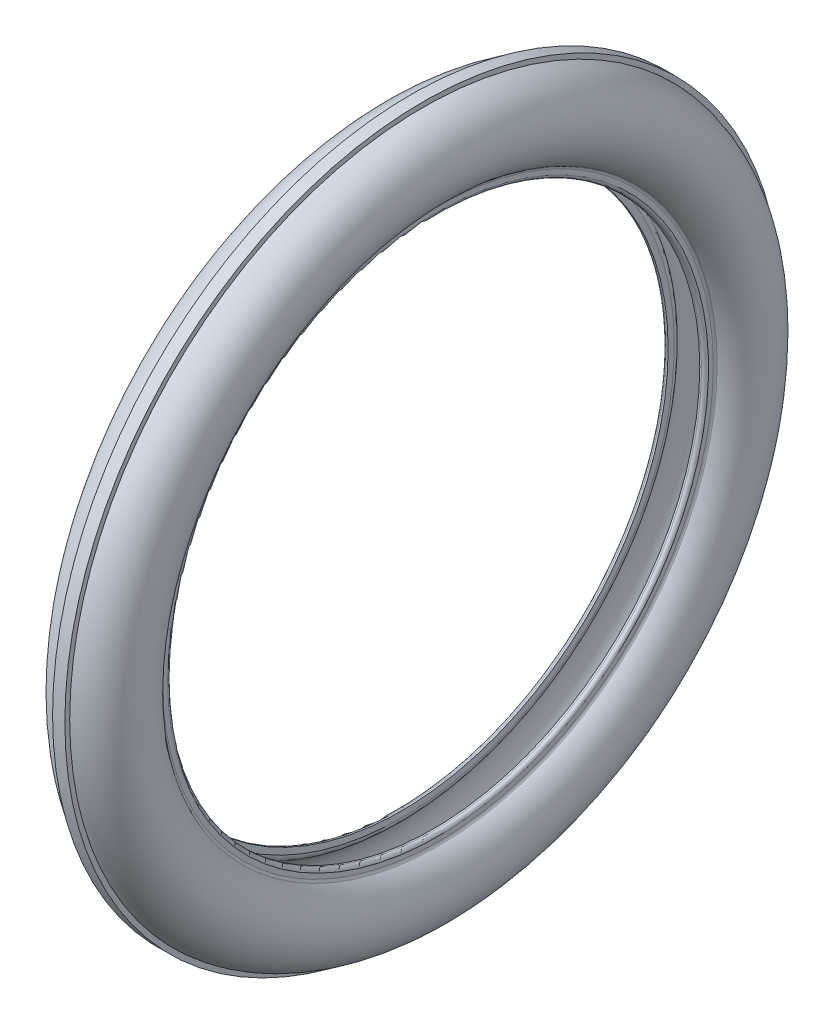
ISO-10303-21;
HEADER;
FILE_DESCRIPTION(('STEP AP214'),'2;1');
FILE_NAME('part.step','',(''),(''),'','','');
FILE_SCHEMA(('AUTOMOTIVE_DESIGN { 1 0 10303 214 1 1 1 1 }'));
ENDSEC;
DATA;
#1=APPLICATION_CONTEXT('core data for automotive mechanical design processes');
#2=APPLICATION_PROTOCOL_DEFINITION('international standard','automotive_design',2000,#1);
#3=PRODUCT_CONTEXT('',#1,'mechanical');
#4=PRODUCT('Part','Part','',(#3));
#5=PRODUCT_RELATED_PRODUCT_CATEGORY('part','',(#4));
#6=PRODUCT_DEFINITION_FORMATION('','',#4);
#7=PRODUCT_DEFINITION_CONTEXT('part definition',#1,'design');
#8=PRODUCT_DEFINITION('design','',#6,#7);
#9=PRODUCT_DEFINITION_SHAPE('','',#8);
#10=(LENGTH_UNIT() NAMED_UNIT(*) SI_UNIT(.MILLI.,.METRE.));
#11=(NAMED_UNIT(*) PLANE_ANGLE_UNIT() SI_UNIT($,.RADIAN.));
#12=(NAMED_UNIT(*) SI_UNIT($,.STERADIAN.) SOLID_ANGLE_UNIT());
#13=UNCERTAINTY_MEASURE_WITH_UNIT(LENGTH_MEASURE(1.E-05),#10,'distance_accuracy_value','');
#14=(GEOMETRIC_REPRESENTATION_CONTEXT(3) GLOBAL_UNCERTAINTY_ASSIGNED_CONTEXT((#13)) GLOBAL_UNIT_ASSIGNED_CONTEXT((#10,
#11,#12)) REPRESENTATION_CONTEXT('',''));
#15=CARTESIAN_POINT('',(0.,0.,0.));
#16=DIRECTION('',(0.,0.,1.));
#17=DIRECTION('',(1.,0.,0.));
#18=AXIS2_PLACEMENT_3D('',#15,#16,#17);
#19=CARTESIAN_POINT('',(-9.,152.,0.));
#20=DIRECTION('',(-1.,0.,0.));
#21=DIRECTION('',(0.,0.,1.));
#22=AXIS2_PLACEMENT_3D('',#19,#20,#21);
#23=PLANE('',#22);
#24=CARTESIAN_POINT('',(-8.99999999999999,0.,0.));
#25=DIRECTION('',(-1.,0.,0.));
#26=DIRECTION('',(0.,0.,1.));
#27=AXIS2_PLACEMENT_3D('',#24,#25,#26);
#28=CIRCLE('',#27,155.483339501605);
#29=CARTESIAN_POINT('',(-8.99999999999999,0.,155.483339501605));
#30=VERTEX_POINT('',#29);
#31=EDGE_CURVE('E10',#30,#30,#28,.T.);
#32=ORIENTED_EDGE('',*,*,#31,.F.);
#33=EDGE_LOOP('',(#32));
#34=FACE_BOUND('',#33,.T.);
#35=CARTESIAN_POINT('',(-9.,0.,0.));
#36=DIRECTION('',(-1.,0.,0.));
#37=DIRECTION('',(0.,0.,1.));
#38=AXIS2_PLACEMENT_3D('',#35,#36,#37);
#39=CIRCLE('',#38,152.);
#40=CARTESIAN_POINT('',(-9.,0.,152.));
#41=VERTEX_POINT('',#40);
#42=EDGE_CURVE('E62',#41,#41,#39,.T.);
#43=ORIENTED_EDGE('',*,*,#42,.T.);
#44=EDGE_LOOP('',(#43));
#45=FACE_BOUND('',#44,.T.);
#46=ADVANCED_FACE('F31',(#34,#45),#23,.F.);
#47=CARTESIAN_POINT('',(-13.,0.,0.));
#48=DIRECTION('',(-1.,0.,0.));
#49=DIRECTION('',(0.,0.,1.));
#50=AXIS2_PLACEMENT_3D('',#47,#48,#49);
#51=TOROIDAL_SURFACE('',#50,155.483339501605,4.00000000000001);
#52=CARTESIAN_POINT('',(-11.,0.,0.));
#53=DIRECTION('',(-1.,0.,0.));
#54=DIRECTION('',(0.,0.,1.));
#55=AXIS2_PLACEMENT_3D('',#52,#53,#54);
#56=CIRCLE('',#55,158.947441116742);
#57=CARTESIAN_POINT('',(-11.,0.,158.947441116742));
#58=VERTEX_POINT('',#57);
#59=EDGE_CURVE('E37',#58,#58,#56,.T.);
#60=ORIENTED_EDGE('',*,*,#59,.F.);
#61=EDGE_LOOP('',(#60));
#62=FACE_BOUND('',#61,.T.);
#63=ORIENTED_EDGE('',*,*,#31,.T.);
#64=EDGE_LOOP('',(#63));
#65=FACE_BOUND('',#64,.T.);
#66=ADVANCED_FACE('F113',(#62,#65),#51,.T.);
#67=CARTESIAN_POINT('',(0.,0.,0.));
#68=DIRECTION('',(-1.,0.,0.));
#69=DIRECTION('',(0.,0.,1.));
#70=AXIS2_PLACEMENT_3D('',#67,#68,#69);
#71=TOROIDAL_SURFACE('',#70,178.,22.);
#72=ORIENTED_EDGE('',*,*,#59,.T.);
#73=EDGE_LOOP('',(#72));
#74=FACE_BOUND('',#73,.T.);
#75=CARTESIAN_POINT('',(11.,0.,0.));
#76=DIRECTION('',(-1.,0.,0.));
#77=DIRECTION('',(0.,0.,1.));
#78=AXIS2_PLACEMENT_3D('',#75,#76,#77);
#79=CIRCLE('',#78,158.947441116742);
#80=CARTESIAN_POINT('',(11.,0.,158.947441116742));
#81=VERTEX_POINT('',#80);
#82=EDGE_CURVE('E68',#81,#81,#79,.T.);
#83=ORIENTED_EDGE('',*,*,#82,.F.);
#84=EDGE_LOOP('',(#83));
#85=FACE_BOUND('',#84,.T.);
#86=ADVANCED_FACE('F118',(#74,#85),#71,.F.);
#87=CARTESIAN_POINT('',(0.,0.,0.));
#88=DIRECTION('',(-1.,0.,0.));
#89=DIRECTION('',(0.,0.,1.));
#90=AXIS2_PLACEMENT_3D('',#87,#88,#89);
#91=CYLINDRICAL_SURFACE('',#90,204.);
#92=CARTESIAN_POINT('',(-3.5,0.,0.));
#93=DIRECTION('',(-1.,0.,0.));
#94=DIRECTION('',(0.,0.,1.));
#95=AXIS2_PLACEMENT_3D('',#92,#93,#94);
#96=CIRCLE('',#95,204.);
#97=CARTESIAN_POINT('',(-3.5,0.,204.));
#98=VERTEX_POINT('',#97);
#99=EDGE_CURVE('E41',#98,#98,#96,.T.);
#100=ORIENTED_EDGE('',*,*,#99,.F.);
#101=EDGE_LOOP('',(#100));
#102=FACE_BOUND('',#101,.T.);
#103=CARTESIAN_POINT('',(3.5,0.,0.));
#104=DIRECTION('',(-1.,0.,0.));
#105=DIRECTION('',(0.,0.,1.));
#106=AXIS2_PLACEMENT_3D('',#103,#104,#105);
#107=CIRCLE('',#106,204.);
#108=CARTESIAN_POINT('',(3.5,0.,204.));
#109=VERTEX_POINT('',#108);
#110=EDGE_CURVE('E71',#109,#109,#107,.T.);
#111=ORIENTED_EDGE('',*,*,#110,.T.);
#112=EDGE_LOOP('',(#111));
#113=FACE_BOUND('',#112,.T.);
#114=ADVANCED_FACE('F151',(#102,#113),#91,.T.);
#115=CARTESIAN_POINT('',(-3.5,201.237900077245,0.));
#116=DIRECTION('',(1.,0.,0.));
#117=DIRECTION('',(0.,0.,-1.));
#118=AXIS2_PLACEMENT_3D('',#115,#116,#117);
#119=PLANE('',#118);
#120=CARTESIAN_POINT('',(-3.5,0.,0.));
#121=DIRECTION('',(-1.,0.,0.));
#122=DIRECTION('',(0.,0.,1.));
#123=AXIS2_PLACEMENT_3D('',#120,#121,#122);
#124=CIRCLE('',#123,201.237900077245);
#125=CARTESIAN_POINT('',(-3.5,0.,201.237900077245));
#126=VERTEX_POINT('',#125);
#127=EDGE_CURVE('E45',#126,#126,#124,.T.);
#128=ORIENTED_EDGE('',*,*,#127,.F.);
#129=EDGE_LOOP('',(#128));
#130=FACE_BOUND('',#129,.T.);
#131=ORIENTED_EDGE('',*,*,#99,.T.);
#132=EDGE_LOOP('',(#131));
#133=FACE_BOUND('',#132,.T.);
#134=ADVANCED_FACE('F145',(#130,#133),#119,.F.);
#135=CARTESIAN_POINT('',(0.,0.,0.));
#136=DIRECTION('',(-1.,0.,0.));
#137=DIRECTION('',(0.,0.,1.));
#138=AXIS2_PLACEMENT_3D('',#135,#136,#137);
#139=TOROIDAL_SURFACE('',#138,178.,23.5);
#140=CARTESIAN_POINT('',(-12.6782802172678,0.,0.));
#141=DIRECTION('',(-1.,0.,0.));
#142=DIRECTION('',(0.,0.,1.));
#143=AXIS2_PLACEMENT_3D('',#140,#141,#142);
#144=CIRCLE('',#143,158.213357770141);
#145=CARTESIAN_POINT('',(-12.6782802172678,0.,158.213357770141));
#146=VERTEX_POINT('',#145);
#147=EDGE_CURVE('E50',#146,#146,#144,.T.);
#148=ORIENTED_EDGE('',*,*,#147,.F.);
#149=EDGE_LOOP('',(#148));
#150=FACE_BOUND('',#149,.T.);
#151=ORIENTED_EDGE('',*,*,#127,.T.);
#152=EDGE_LOOP('',(#151));
#153=FACE_BOUND('',#152,.T.);
#154=ADVANCED_FACE('F139',(#150,#153),#139,.T.);
#155=CARTESIAN_POINT('',(-14.,0.,0.));
#156=DIRECTION('',(-1.,0.,0.));
#157=DIRECTION('',(0.,0.,1.));
#158=AXIS2_PLACEMENT_3D('',#155,#156,#157);
#159=TOROIDAL_SURFACE('',#158,156.71233917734,2.);
#160=CARTESIAN_POINT('',(-12.,0.,0.));
#161=DIRECTION('',(-1.,0.,0.));
#162=DIRECTION('',(0.,0.,1.));
#163=AXIS2_PLACEMENT_3D('',#160,#161,#162);
#164=CIRCLE('',#163,156.71233917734);
#165=CARTESIAN_POINT('',(-12.,0.,156.71233917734));
#166=VERTEX_POINT('',#165);
#167=EDGE_CURVE('E53',#166,#166,#164,.T.);
#168=ORIENTED_EDGE('',*,*,#167,.F.);
#169=EDGE_LOOP('',(#168));
#170=FACE_BOUND('',#169,.T.);
#171=ORIENTED_EDGE('',*,*,#147,.T.);
#172=EDGE_LOOP('',(#171));
#173=FACE_BOUND('',#172,.T.);
#174=ADVANCED_FACE('F133',(#170,#173),#159,.F.);
#175=CARTESIAN_POINT('',(-12.,154.,0.));
#176=DIRECTION('',(1.,0.,0.));
#177=DIRECTION('',(0.,0.,-1.));
#178=AXIS2_PLACEMENT_3D('',#175,#176,#177);
#179=PLANE('',#178);
#180=CARTESIAN_POINT('',(-12.,0.,0.));
#181=DIRECTION('',(-1.,0.,0.));
#182=DIRECTION('',(0.,0.,1.));
#183=AXIS2_PLACEMENT_3D('',#180,#181,#182);
#184=CIRCLE('',#183,154.);
#185=CARTESIAN_POINT('',(-12.,0.,154.));
#186=VERTEX_POINT('',#185);
#187=EDGE_CURVE('E56',#186,#186,#184,.T.);
#188=ORIENTED_EDGE('',*,*,#187,.F.);
#189=EDGE_LOOP('',(#188));
#190=FACE_BOUND('',#189,.T.);
#191=ORIENTED_EDGE('',*,*,#167,.T.);
#192=EDGE_LOOP('',(#191));
#193=FACE_BOUND('',#192,.T.);
#194=ADVANCED_FACE('F127',(#190,#193),#179,.F.);
#195=CARTESIAN_POINT('',(-10.,0.,0.));
#196=DIRECTION('',(-1.,0.,0.));
#197=DIRECTION('',(0.,0.,1.));
#198=AXIS2_PLACEMENT_3D('',#195,#196,#197);
#199=TOROIDAL_SURFACE('',#198,154.,2.);
#200=CARTESIAN_POINT('',(-9.99999999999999,0.,0.));
#201=DIRECTION('',(-1.,0.,0.));
#202=DIRECTION('',(0.,0.,1.));
#203=AXIS2_PLACEMENT_3D('',#200,#201,#202);
#204=CIRCLE('',#203,152.);
#205=CARTESIAN_POINT('',(-9.99999999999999,0.,152.));
#206=VERTEX_POINT('',#205);
#207=EDGE_CURVE('E59',#206,#206,#204,.T.);
#208=ORIENTED_EDGE('',*,*,#207,.F.);
#209=EDGE_LOOP('',(#208));
#210=FACE_BOUND('',#209,.T.);
#211=ORIENTED_EDGE('',*,*,#187,.T.);
#212=EDGE_LOOP('',(#211));
#213=FACE_BOUND('',#212,.T.);
#214=ADVANCED_FACE('F109',(#210,#213),#199,.T.);
#215=CARTESIAN_POINT('',(0.,0.,0.));
#216=DIRECTION('',(-1.,0.,0.));
#217=DIRECTION('',(0.,0.,1.));
#218=AXIS2_PLACEMENT_3D('',#215,#216,#217);
#219=CYLINDRICAL_SURFACE('',#218,152.);
#220=ORIENTED_EDGE('',*,*,#42,.F.);
#221=EDGE_LOOP('',(#220));
#222=FACE_BOUND('',#221,.T.);
#223=ORIENTED_EDGE('',*,*,#207,.T.);
#224=EDGE_LOOP('',(#223));
#225=FACE_BOUND('',#224,.T.);
#226=ADVANCED_FACE('F99',(#222,#225),#219,.F.);
#227=CARTESIAN_POINT('',(9.,152.,0.));
#228=DIRECTION('',(1.,0.,0.));
#229=DIRECTION('',(0.,0.,1.));
#230=AXIS2_PLACEMENT_3D('',#227,#228,#229);
#231=PLANE('',#230);
#232=CARTESIAN_POINT('',(8.99999999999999,0.,0.));
#233=DIRECTION('',(-1.,0.,0.));
#234=DIRECTION('',(0.,0.,1.));
#235=AXIS2_PLACEMENT_3D('',#232,#233,#234);
#236=CIRCLE('',#235,155.483339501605);
#237=CARTESIAN_POINT('',(8.99999999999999,0.,155.483339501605));
#238=VERTEX_POINT('',#237);
#239=EDGE_CURVE('E65',#238,#238,#236,.T.);
#240=ORIENTED_EDGE('',*,*,#239,.T.);
#241=EDGE_LOOP('',(#240));
#242=FACE_BOUND('',#241,.T.);
#243=CARTESIAN_POINT('',(9.,0.,0.));
#244=DIRECTION('',(-1.,0.,0.));
#245=DIRECTION('',(0.,0.,1.));
#246=AXIS2_PLACEMENT_3D('',#243,#244,#245);
#247=CIRCLE('',#246,152.);
#248=CARTESIAN_POINT('',(9.,0.,152.));
#249=VERTEX_POINT('',#248);
#250=EDGE_CURVE('E89',#249,#249,#247,.T.);
#251=ORIENTED_EDGE('',*,*,#250,.F.);
#252=EDGE_LOOP('',(#251));
#253=FACE_BOUND('',#252,.T.);
#254=ADVANCED_FACE('F96',(#242,#253),#231,.F.);
#255=CARTESIAN_POINT('',(13.,0.,0.));
#256=DIRECTION('',(1.,0.,0.));
#257=DIRECTION('',(0.,0.,1.));
#258=AXIS2_PLACEMENT_3D('',#255,#256,#257);
#259=TOROIDAL_SURFACE('',#258,155.483339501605,4.00000000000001);
#260=ORIENTED_EDGE('',*,*,#82,.T.);
#261=EDGE_LOOP('',(#260));
#262=FACE_BOUND('',#261,.T.);
#263=ORIENTED_EDGE('',*,*,#239,.F.);
#264=EDGE_LOOP('',(#263));
#265=FACE_BOUND('',#264,.T.);
#266=ADVANCED_FACE('F98',(#262,#265),#259,.T.);
#267=CARTESIAN_POINT('',(3.5,201.237900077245,0.));
#268=DIRECTION('',(-1.,0.,0.));
#269=DIRECTION('',(0.,0.,-1.));
#270=AXIS2_PLACEMENT_3D('',#267,#268,#269);
#271=PLANE('',#270);
#272=CARTESIAN_POINT('',(3.5,0.,0.));
#273=DIRECTION('',(-1.,0.,0.));
#274=DIRECTION('',(0.,0.,1.));
#275=AXIS2_PLACEMENT_3D('',#272,#273,#274);
#276=CIRCLE('',#275,201.237900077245);
#277=CARTESIAN_POINT('',(3.5,0.,201.237900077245));
#278=VERTEX_POINT('',#277);
#279=EDGE_CURVE('E74',#278,#278,#276,.T.);
#280=ORIENTED_EDGE('',*,*,#279,.T.);
#281=EDGE_LOOP('',(#280));
#282=FACE_BOUND('',#281,.T.);
#283=ORIENTED_EDGE('',*,*,#110,.F.);
#284=EDGE_LOOP('',(#283));
#285=FACE_BOUND('',#284,.T.);
#286=ADVANCED_FACE('F106',(#282,#285),#271,.F.);
#287=CARTESIAN_POINT('',(0.,0.,0.));
#288=DIRECTION('',(1.,0.,0.));
#289=DIRECTION('',(0.,0.,1.));
#290=AXIS2_PLACEMENT_3D('',#287,#288,#289);
#291=TOROIDAL_SURFACE('',#290,178.,23.5);
#292=CARTESIAN_POINT('',(12.6782802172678,0.,0.));
#293=DIRECTION('',(-1.,0.,0.));
#294=DIRECTION('',(0.,0.,1.));
#295=AXIS2_PLACEMENT_3D('',#292,#293,#294);
#296=CIRCLE('',#295,158.213357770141);
#297=CARTESIAN_POINT('',(12.6782802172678,0.,158.213357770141));
#298=VERTEX_POINT('',#297);
#299=EDGE_CURVE('E77',#298,#298,#296,.T.);
#300=ORIENTED_EDGE('',*,*,#299,.T.);
#301=EDGE_LOOP('',(#300));
#302=FACE_BOUND('',#301,.T.);
#303=ORIENTED_EDGE('',*,*,#279,.F.);
#304=EDGE_LOOP('',(#303));
#305=FACE_BOUND('',#304,.T.);
#306=ADVANCED_FACE('F161',(#302,#305),#291,.T.);
#307=CARTESIAN_POINT('',(14.,0.,0.));
#308=DIRECTION('',(1.,0.,0.));
#309=DIRECTION('',(0.,0.,1.));
#310=AXIS2_PLACEMENT_3D('',#307,#308,#309);
#311=TOROIDAL_SURFACE('',#310,156.71233917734,2.);
#312=CARTESIAN_POINT('',(12.,0.,0.));
#313=DIRECTION('',(-1.,0.,0.));
#314=DIRECTION('',(0.,0.,1.));
#315=AXIS2_PLACEMENT_3D('',#312,#313,#314);
#316=CIRCLE('',#315,156.71233917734);
#317=CARTESIAN_POINT('',(12.,0.,156.71233917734));
#318=VERTEX_POINT('',#317);
#319=EDGE_CURVE('E80',#318,#318,#316,.T.);
#320=ORIENTED_EDGE('',*,*,#319,.T.);
#321=EDGE_LOOP('',(#320));
#322=FACE_BOUND('',#321,.T.);
#323=ORIENTED_EDGE('',*,*,#299,.F.);
#324=EDGE_LOOP('',(#323));
#325=FACE_BOUND('',#324,.T.);
#326=ADVANCED_FACE('F167',(#322,#325),#311,.F.);
#327=CARTESIAN_POINT('',(12.,154.,0.));
#328=DIRECTION('',(-1.,0.,0.));
#329=DIRECTION('',(0.,0.,-1.));
#330=AXIS2_PLACEMENT_3D('',#327,#328,#329);
#331=PLANE('',#330);
#332=CARTESIAN_POINT('',(12.,0.,0.));
#333=DIRECTION('',(-1.,0.,0.));
#334=DIRECTION('',(0.,0.,1.));
#335=AXIS2_PLACEMENT_3D('',#332,#333,#334);
#336=CIRCLE('',#335,154.);
#337=CARTESIAN_POINT('',(12.,0.,154.));
#338=VERTEX_POINT('',#337);
#339=EDGE_CURVE('E83',#338,#338,#336,.T.);
#340=ORIENTED_EDGE('',*,*,#339,.T.);
#341=EDGE_LOOP('',(#340));
#342=FACE_BOUND('',#341,.T.);
#343=ORIENTED_EDGE('',*,*,#319,.F.);
#344=EDGE_LOOP('',(#343));
#345=FACE_BOUND('',#344,.T.);
#346=ADVANCED_FACE('F173',(#342,#345),#331,.F.);
#347=CARTESIAN_POINT('',(10.,0.,0.));
#348=DIRECTION('',(1.,0.,0.));
#349=DIRECTION('',(0.,0.,1.));
#350=AXIS2_PLACEMENT_3D('',#347,#348,#349);
#351=TOROIDAL_SURFACE('',#350,154.,2.);
#352=CARTESIAN_POINT('',(9.99999999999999,0.,0.));
#353=DIRECTION('',(-1.,0.,0.));
#354=DIRECTION('',(0.,0.,1.));
#355=AXIS2_PLACEMENT_3D('',#352,#353,#354);
#356=CIRCLE('',#355,152.);
#357=CARTESIAN_POINT('',(9.99999999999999,0.,152.));
#358=VERTEX_POINT('',#357);
#359=EDGE_CURVE('E86',#358,#358,#356,.T.);
#360=ORIENTED_EDGE('',*,*,#359,.T.);
#361=EDGE_LOOP('',(#360));
#362=FACE_BOUND('',#361,.T.);
#363=ORIENTED_EDGE('',*,*,#339,.F.);
#364=EDGE_LOOP('',(#363));
#365=FACE_BOUND('',#364,.T.);
#366=ADVANCED_FACE('F177',(#362,#365),#351,.T.);
#367=CARTESIAN_POINT('',(0.,0.,0.));
#368=DIRECTION('',(1.,0.,0.));
#369=DIRECTION('',(0.,0.,1.));
#370=AXIS2_PLACEMENT_3D('',#367,#368,#369);
#371=CYLINDRICAL_SURFACE('',#370,152.);
#372=ORIENTED_EDGE('',*,*,#250,.T.);
#373=EDGE_LOOP('',(#372));
#374=FACE_BOUND('',#373,.T.);
#375=ORIENTED_EDGE('',*,*,#359,.F.);
#376=EDGE_LOOP('',(#375));
#377=FACE_BOUND('',#376,.T.);
#378=ADVANCED_FACE('F93',(#374,#377),#371,.F.);
#379=CLOSED_SHELL('',(#46,#66,#86,#114,#134,#154,#174,#194,#214,#226,#254,#266,#286,#306,#326,
#346,#366,#378));
#380=MANIFOLD_SOLID_BREP('B2',#379);
#381=ADVANCED_BREP_SHAPE_REPRESENTATION('',(#18,#380),#14);
#382=SHAPE_DEFINITION_REPRESENTATION(#9,#381);
ENDSEC;
END-ISO-10303-21;
